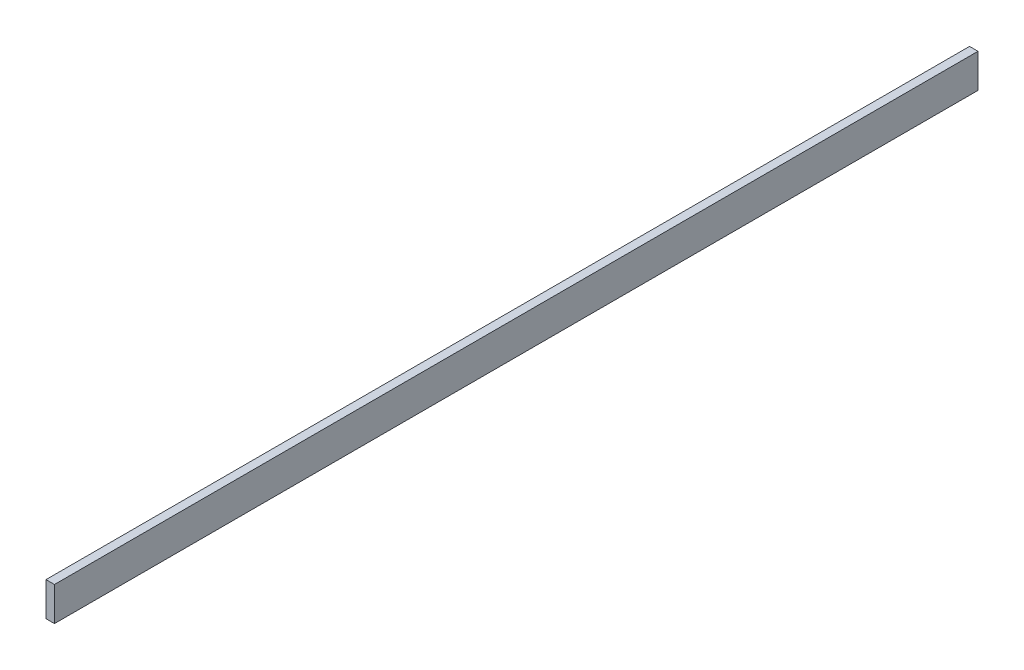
ISO-10303-21;
HEADER;
FILE_DESCRIPTION(('STEP AP214'),'2;1');
FILE_NAME('part.step','',(''),(''),'','','');
FILE_SCHEMA(('AUTOMOTIVE_DESIGN { 1 0 10303 214 1 1 1 1 }'));
ENDSEC;
DATA;
#1=APPLICATION_CONTEXT('core data for automotive mechanical design processes');
#2=APPLICATION_PROTOCOL_DEFINITION('international standard','automotive_design',2000,#1);
#3=PRODUCT_CONTEXT('',#1,'mechanical');
#4=PRODUCT('Part','Part','',(#3));
#5=PRODUCT_RELATED_PRODUCT_CATEGORY('part','',(#4));
#6=PRODUCT_DEFINITION_FORMATION('','',#4);
#7=PRODUCT_DEFINITION_CONTEXT('part definition',#1,'design');
#8=PRODUCT_DEFINITION('design','',#6,#7);
#9=PRODUCT_DEFINITION_SHAPE('','',#8);
#10=(LENGTH_UNIT() NAMED_UNIT(*) SI_UNIT(.MILLI.,.METRE.));
#11=(NAMED_UNIT(*) PLANE_ANGLE_UNIT() SI_UNIT($,.RADIAN.));
#12=(NAMED_UNIT(*) SI_UNIT($,.STERADIAN.) SOLID_ANGLE_UNIT());
#13=UNCERTAINTY_MEASURE_WITH_UNIT(LENGTH_MEASURE(1.E-05),#10,'distance_accuracy_value','');
#14=(GEOMETRIC_REPRESENTATION_CONTEXT(3) GLOBAL_UNCERTAINTY_ASSIGNED_CONTEXT((#13)) GLOBAL_UNIT_ASSIGNED_CONTEXT((#10,
#11,#12)) REPRESENTATION_CONTEXT('',''));
#15=CARTESIAN_POINT('',(0.,0.,0.));
#16=DIRECTION('',(0.,0.,1.));
#17=DIRECTION('',(1.,0.,0.));
#18=AXIS2_PLACEMENT_3D('',#15,#16,#17);
#19=CARTESIAN_POINT('',(-2.5,19.9999999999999,545.));
#20=DIRECTION('',(1.,0.,0.));
#21=DIRECTION('',(0.,1.,0.));
#22=AXIS2_PLACEMENT_3D('',#19,#20,#21);
#23=PLANE('',#22);
#24=DIRECTION('',(0.,-1.,0.));
#25=VECTOR('',#24,1.);
#26=CARTESIAN_POINT('',(-2.5,20.,0.));
#27=LINE('',#26,#25);
#28=CARTESIAN_POINT('',(-2.5,20.,0.));
#29=VERTEX_POINT('',#28);
#30=CARTESIAN_POINT('',(-2.5,0.,0.));
#31=VERTEX_POINT('',#30);
#32=EDGE_CURVE('E83',#29,#31,#27,.T.);
#33=ORIENTED_EDGE('',*,*,#32,.T.);
#34=DIRECTION('',(0.,0.,-1.));
#35=VECTOR('',#34,1.);
#36=CARTESIAN_POINT('',(-2.5,0.,545.));
#37=LINE('',#36,#35);
#38=CARTESIAN_POINT('',(-2.5,0.,545.));
#39=VERTEX_POINT('',#38);
#40=EDGE_CURVE('E11',#39,#31,#37,.T.);
#41=ORIENTED_EDGE('',*,*,#40,.F.);
#42=DIRECTION('',(0.,-1.,0.));
#43=VECTOR('',#42,1.);
#44=CARTESIAN_POINT('',(-2.5,19.9999999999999,545.));
#45=LINE('',#44,#43);
#46=CARTESIAN_POINT('',(-2.5,19.9999999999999,545.));
#47=VERTEX_POINT('',#46);
#48=EDGE_CURVE('E105',#47,#39,#45,.T.);
#49=ORIENTED_EDGE('',*,*,#48,.F.);
#50=DIRECTION('',(0.,0.,-1.));
#51=VECTOR('',#50,1.);
#52=CARTESIAN_POINT('',(-2.5,19.9999999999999,545.));
#53=LINE('',#52,#51);
#54=EDGE_CURVE('E96',#47,#29,#53,.T.);
#55=ORIENTED_EDGE('',*,*,#54,.T.);
#56=EDGE_LOOP('',(#33,#41,#49,#55));
#57=FACE_BOUND('',#56,.T.);
#58=ADVANCED_FACE('F38',(#57),#23,.F.);
#59=CARTESIAN_POINT('',(-2.5,0.,545.));
#60=DIRECTION('',(0.,1.,0.));
#61=DIRECTION('',(0.,0.,1.));
#62=AXIS2_PLACEMENT_3D('',#59,#60,#61);
#63=PLANE('',#62);
#64=DIRECTION('',(1.,0.,0.));
#65=VECTOR('',#64,1.);
#66=CARTESIAN_POINT('',(-2.5,0.,0.));
#67=LINE('',#66,#65);
#68=CARTESIAN_POINT('',(2.5,0.,0.));
#69=VERTEX_POINT('',#68);
#70=EDGE_CURVE('E79',#31,#69,#67,.T.);
#71=ORIENTED_EDGE('',*,*,#70,.T.);
#72=DIRECTION('',(0.,0.,-1.));
#73=VECTOR('',#72,1.);
#74=CARTESIAN_POINT('',(2.5,0.,545.));
#75=LINE('',#74,#73);
#76=CARTESIAN_POINT('',(2.5,0.,545.));
#77=VERTEX_POINT('',#76);
#78=EDGE_CURVE('E46',#77,#69,#75,.T.);
#79=ORIENTED_EDGE('',*,*,#78,.F.);
#80=DIRECTION('',(1.,0.,0.));
#81=VECTOR('',#80,1.);
#82=CARTESIAN_POINT('',(-2.5,0.,545.));
#83=LINE('',#82,#81);
#84=EDGE_CURVE('E92',#39,#77,#83,.T.);
#85=ORIENTED_EDGE('',*,*,#84,.F.);
#86=ORIENTED_EDGE('',*,*,#40,.T.);
#87=EDGE_LOOP('',(#71,#79,#85,#86));
#88=FACE_BOUND('',#87,.T.);
#89=ADVANCED_FACE('F91',(#88),#63,.F.);
#90=CARTESIAN_POINT('',(2.5,20.,545.));
#91=DIRECTION('',(-1.,0.,0.));
#92=DIRECTION('',(0.,-1.,0.));
#93=AXIS2_PLACEMENT_3D('',#90,#91,#92);
#94=PLANE('',#93);
#95=DIRECTION('',(0.,1.,0.));
#96=VECTOR('',#95,1.);
#97=CARTESIAN_POINT('',(2.5,20.,0.));
#98=LINE('',#97,#96);
#99=CARTESIAN_POINT('',(2.5,20.,0.));
#100=VERTEX_POINT('',#99);
#101=EDGE_CURVE('E84',#69,#100,#98,.T.);
#102=ORIENTED_EDGE('',*,*,#101,.T.);
#103=DIRECTION('',(0.,0.,-1.));
#104=VECTOR('',#103,1.);
#105=CARTESIAN_POINT('',(2.5,20.,545.));
#106=LINE('',#105,#104);
#107=CARTESIAN_POINT('',(2.5,20.,545.));
#108=VERTEX_POINT('',#107);
#109=EDGE_CURVE('E116',#108,#100,#106,.T.);
#110=ORIENTED_EDGE('',*,*,#109,.F.);
#111=DIRECTION('',(0.,1.,0.));
#112=VECTOR('',#111,1.);
#113=CARTESIAN_POINT('',(2.5,20.,545.));
#114=LINE('',#113,#112);
#115=EDGE_CURVE('E58',#77,#108,#114,.T.);
#116=ORIENTED_EDGE('',*,*,#115,.F.);
#117=ORIENTED_EDGE('',*,*,#78,.T.);
#118=EDGE_LOOP('',(#102,#110,#116,#117));
#119=FACE_BOUND('',#118,.T.);
#120=ADVANCED_FACE('F121',(#119),#94,.F.);
#121=CARTESIAN_POINT('',(-2.5,19.9999999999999,545.));
#122=DIRECTION('',(0.,-1.,0.));
#123=DIRECTION('',(0.,0.,-1.));
#124=AXIS2_PLACEMENT_3D('',#121,#122,#123);
#125=PLANE('',#124);
#126=DIRECTION('',(-1.,0.,0.));
#127=VECTOR('',#126,1.);
#128=CARTESIAN_POINT('',(-2.5,20.,0.));
#129=LINE('',#128,#127);
#130=EDGE_CURVE('E103',#100,#29,#129,.T.);
#131=ORIENTED_EDGE('',*,*,#130,.T.);
#132=ORIENTED_EDGE('',*,*,#54,.F.);
#133=DIRECTION('',(-1.,0.,0.));
#134=VECTOR('',#133,1.);
#135=CARTESIAN_POINT('',(-2.5,19.9999999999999,545.));
#136=LINE('',#135,#134);
#137=EDGE_CURVE('E53',#108,#47,#136,.T.);
#138=ORIENTED_EDGE('',*,*,#137,.F.);
#139=ORIENTED_EDGE('',*,*,#109,.T.);
#140=EDGE_LOOP('',(#131,#132,#138,#139));
#141=FACE_BOUND('',#140,.T.);
#142=ADVANCED_FACE('F123',(#141),#125,.F.);
#143=CARTESIAN_POINT('',(-2.5,0.,545.));
#144=DIRECTION('',(0.,0.,1.));
#145=DIRECTION('',(1.,0.,0.));
#146=AXIS2_PLACEMENT_3D('',#143,#144,#145);
#147=PLANE('',#146);
#148=ORIENTED_EDGE('',*,*,#48,.T.);
#149=ORIENTED_EDGE('',*,*,#84,.T.);
#150=ORIENTED_EDGE('',*,*,#115,.T.);
#151=ORIENTED_EDGE('',*,*,#137,.T.);
#152=EDGE_LOOP('',(#148,#149,#150,#151));
#153=FACE_BOUND('',#152,.T.);
#154=ADVANCED_FACE('F124',(#153),#147,.T.);
#155=CARTESIAN_POINT('',(-2.5,0.,0.));
#156=DIRECTION('',(0.,0.,1.));
#157=DIRECTION('',(1.,0.,0.));
#158=AXIS2_PLACEMENT_3D('',#155,#156,#157);
#159=PLANE('',#158);
#160=ORIENTED_EDGE('',*,*,#32,.F.);
#161=ORIENTED_EDGE('',*,*,#130,.F.);
#162=ORIENTED_EDGE('',*,*,#101,.F.);
#163=ORIENTED_EDGE('',*,*,#70,.F.);
#164=EDGE_LOOP('',(#160,#161,#162,#163));
#165=FACE_BOUND('',#164,.T.);
#166=ADVANCED_FACE('F80',(#165),#159,.F.);
#167=CLOSED_SHELL('',(#58,#89,#120,#142,#154,#166));
#168=MANIFOLD_SOLID_BREP('B2',#167);
#169=ADVANCED_BREP_SHAPE_REPRESENTATION('',(#18,#168),#14);
#170=SHAPE_DEFINITION_REPRESENTATION(#9,#169);
ENDSEC;
END-ISO-10303-21;
